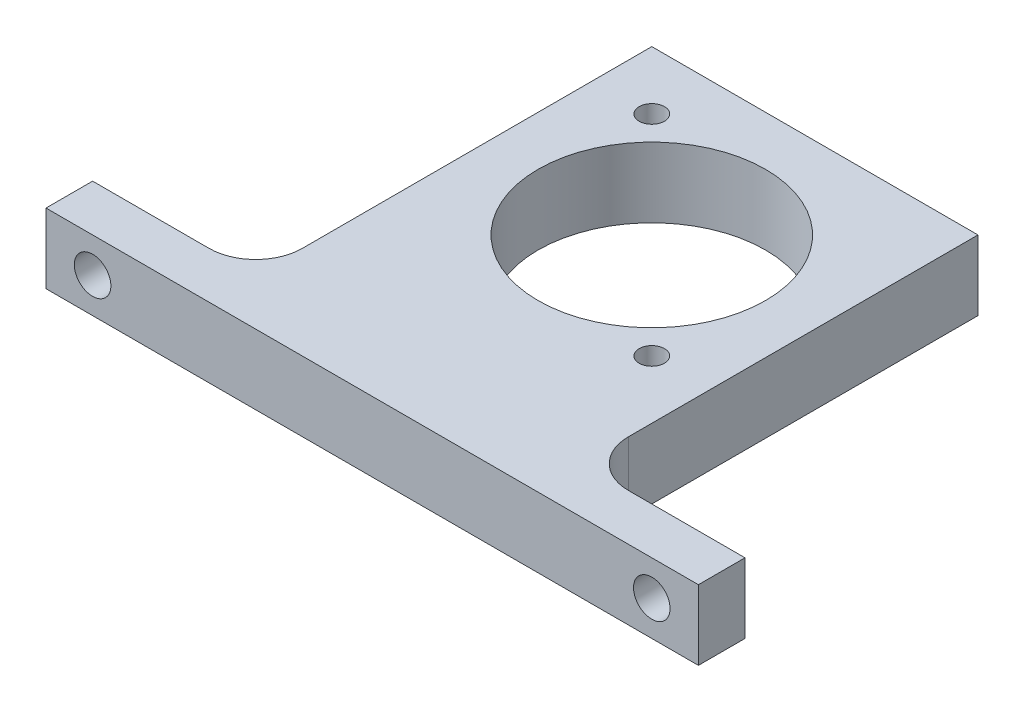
from build123d import *

# Parameters (mm, degrees)
SKETCH1_W             = 44.45
SKETCH1_H             = 60.325
BOSS_EXTRUDE1_DEPTH   = 9.525
SKETCH7_W             = 22.225
SKETCH7_H             = 9.525
BOSS_EXTRUDE3_DEPTH   = 6.35
FILLET1_R             = 6.35
SKETCH8_R             = 2.4892
CUT_EXTRUDE1_DEPTH    = 6.35
CUT_EXTRUDE2_REACH    = 61.314
SKETCH10_R            = 15.494
SKETCH10_R_2          = 1.7272
F_8_32_TAPPED_HOLE2_D = 3.4544


with BuildPart() as part:
    # Sketch1 → Boss-Extrude1 (new body)
    with BuildSketch(Plane(origin=(0, 0, 0), x_dir=(1, 0, 0), z_dir=(0, 1, 0))):
        with Locations((0, -7.9375)):
            Rectangle(SKETCH1_W, SKETCH1_H)
    extrude(amount=BOSS_EXTRUDE1_DEPTH)

    # Sketch7 → Boss-Extrude3 (add)
    with BuildSketch(Plane.XY.offset(38.1)):
        with Locations((-33.3375, 4.7625)):
            Rectangle(SKETCH7_W, SKETCH7_H)
        with Locations((33.3375, 4.7625)):
            Rectangle(SKETCH7_W, SKETCH7_H)
    extrude(amount=-BOSS_EXTRUDE3_DEPTH)

    # Fillet1
    fillet1_edges = [part.edges().sort_by_distance(p)[0] for p in [
        (-22.225, 4.7625, 31.75),
        (22.225, 4.7625, 31.75),
    ]]
    fillet(fillet1_edges, radius=FILLET1_R)

    # Sketch8 → Cut-Extrude1 (cut)
    with BuildSketch(Plane.XY.offset(38.1)):
        with Locations((-38.1, 4.7625)):
            Circle(SKETCH8_R)
        with Locations((38.1, 4.7625)):
            Circle(SKETCH8_R)
    extrude(amount=-CUT_EXTRUDE1_DEPTH, mode=Mode.SUBTRACT)

    # Sketch10 → Cut-Extrude2 (cut, up to next)
    with BuildSketch(Plane(origin=(0, 9.525, 0), x_dir=(1, 0, 0), z_dir=(0, 1, 0)), mode=Mode.PRIVATE) as cut_extrude2_sk1:
        with Locations(Location((0, 0, 0), (0, 0, 270))):
            Circle(SKETCH10_R)
    cut_extrude2_tool1 = extrude(cut_extrude2_sk1.sketch, amount=-CUT_EXTRUDE2_REACH, mode=Mode.PRIVATE) & part.part
    # Sketch10 → Cut-Extrude2 (cut, up to next)
    with BuildSketch(Plane(origin=(0, 9.525, 0), x_dir=(1, 0, 0), z_dir=(0, 1, 0)), mode=Mode.PRIVATE) as cut_extrude2_sk2:
        with Locations(Location((-14.278607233, 14.278607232, 0), (0, 0, 270))):
            Circle(SKETCH10_R_2)
    cut_extrude2_tool2 = extrude(cut_extrude2_sk2.sketch, amount=-CUT_EXTRUDE2_REACH, mode=Mode.PRIVATE) & part.part
    # Sketch10 → Cut-Extrude2 (cut, up to next)
    with BuildSketch(Plane(origin=(0, 9.525, 0), x_dir=(1, 0, 0), z_dir=(0, 1, 0)), mode=Mode.PRIVATE) as cut_extrude2_sk3:
        with Locations(Location((14.278607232, -14.278607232, 0), (0, 0, 270))):
            Circle(SKETCH10_R_2)
    cut_extrude2_tool3 = extrude(cut_extrude2_sk3.sketch, amount=-CUT_EXTRUDE2_REACH, mode=Mode.PRIVATE) & part.part
    add(cut_extrude2_tool1.solids().sort_by_distance((0, 9.525, 0))[0], mode=Mode.SUBTRACT)
    add(cut_extrude2_tool2.solids().sort_by_distance((-14.278607, 9.525, -14.278607))[0], mode=Mode.SUBTRACT)
    add(cut_extrude2_tool3.solids().sort_by_distance((14.278607, 9.525, 14.278607))[0], mode=Mode.SUBTRACT)

    # 8-32 Tapped Hole2 (through all)
    with Locations(Plane(origin=(0, 9.525, 0), x_dir=(1, 0, 0), z_dir=(0, 1, 0))):
        with Locations((-14.278607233, 14.278607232), (14.278607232, -14.278607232)):
            Hole(F_8_32_TAPPED_HOLE2_D / 2)


solid = part.part
